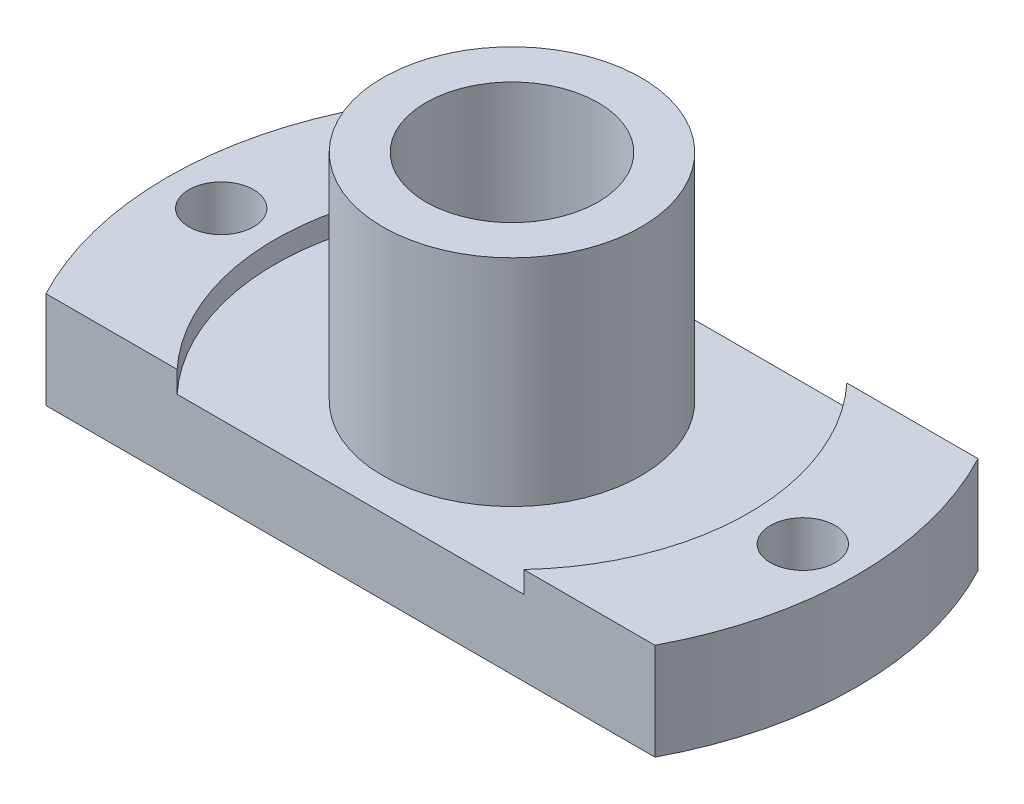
ISO-10303-21;
HEADER;
FILE_DESCRIPTION(('STEP AP214'),'2;1');
FILE_NAME('part.step','',(''),(''),'','','');
FILE_SCHEMA(('AUTOMOTIVE_DESIGN { 1 0 10303 214 1 1 1 1 }'));
ENDSEC;
DATA;
#1=APPLICATION_CONTEXT('core data for automotive mechanical design processes');
#2=APPLICATION_PROTOCOL_DEFINITION('international standard','automotive_design',2000,#1);
#3=PRODUCT_CONTEXT('',#1,'mechanical');
#4=PRODUCT('Part','Part','',(#3));
#5=PRODUCT_RELATED_PRODUCT_CATEGORY('part','',(#4));
#6=PRODUCT_DEFINITION_FORMATION('','',#4);
#7=PRODUCT_DEFINITION_CONTEXT('part definition',#1,'design');
#8=PRODUCT_DEFINITION('design','',#6,#7);
#9=PRODUCT_DEFINITION_SHAPE('','',#8);
#10=(LENGTH_UNIT() NAMED_UNIT(*) SI_UNIT(.MILLI.,.METRE.));
#11=(NAMED_UNIT(*) PLANE_ANGLE_UNIT() SI_UNIT($,.RADIAN.));
#12=(NAMED_UNIT(*) SI_UNIT($,.STERADIAN.) SOLID_ANGLE_UNIT());
#13=UNCERTAINTY_MEASURE_WITH_UNIT(LENGTH_MEASURE(1.E-05),#10,'distance_accuracy_value','');
#14=(GEOMETRIC_REPRESENTATION_CONTEXT(3) GLOBAL_UNCERTAINTY_ASSIGNED_CONTEXT((#13)) GLOBAL_UNIT_ASSIGNED_CONTEXT((#10,
#11,#12)) REPRESENTATION_CONTEXT('',''));
#15=CARTESIAN_POINT('',(0.,0.,0.));
#16=DIRECTION('',(0.,0.,1.));
#17=DIRECTION('',(1.,0.,0.));
#18=AXIS2_PLACEMENT_3D('',#15,#16,#17);
#19=CARTESIAN_POINT('',(0.,7.,0.));
#20=DIRECTION('',(0.,1.,0.));
#21=DIRECTION('',(0.,0.,1.));
#22=AXIS2_PLACEMENT_3D('',#19,#20,#21);
#23=PLANE('',#22);
#24=CARTESIAN_POINT('',(0.,7.,0.));
#25=DIRECTION('',(0.,1.,0.));
#26=DIRECTION('',(0.,0.,1.));
#27=AXIS2_PLACEMENT_3D('',#24,#25,#26);
#28=CIRCLE('',#27,12.);
#29=CARTESIAN_POINT('',(0.,7.,12.));
#30=VERTEX_POINT('',#29);
#31=EDGE_CURVE('E169',#30,#30,#28,.T.);
#32=ORIENTED_EDGE('',*,*,#31,.F.);
#33=EDGE_LOOP('',(#32));
#34=FACE_BOUND('',#33,.T.);
#35=DIRECTION('',(-1.,0.,0.));
#36=VECTOR('',#35,1.);
#37=CARTESIAN_POINT('',(-28.2665880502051,7.,15.));
#38=LINE('',#37,#36);
#39=CARTESIAN_POINT('',(16.0934769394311,7.,15.));
#40=VERTEX_POINT('',#39);
#41=CARTESIAN_POINT('',(-16.0934769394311,7.,15.));
#42=VERTEX_POINT('',#41);
#43=EDGE_CURVE('E158',#40,#42,#38,.T.);
#44=ORIENTED_EDGE('',*,*,#43,.F.);
#45=CARTESIAN_POINT('',(0.,7.,0.));
#46=DIRECTION('',(0.,-1.,0.));
#47=DIRECTION('',(0.,0.,1.));
#48=AXIS2_PLACEMENT_3D('',#45,#46,#47);
#49=CIRCLE('',#48,22.);
#50=CARTESIAN_POINT('',(16.0934769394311,7.,-15.));
#51=VERTEX_POINT('',#50);
#52=EDGE_CURVE('E125',#51,#40,#49,.T.);
#53=ORIENTED_EDGE('',*,*,#52,.F.);
#54=DIRECTION('',(1.,0.,0.));
#55=VECTOR('',#54,1.);
#56=CARTESIAN_POINT('',(-28.2665880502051,7.,-15.));
#57=LINE('',#56,#55);
#58=CARTESIAN_POINT('',(-16.0934769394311,7.,-15.));
#59=VERTEX_POINT('',#58);
#60=EDGE_CURVE('E156',#59,#51,#57,.T.);
#61=ORIENTED_EDGE('',*,*,#60,.F.);
#62=CARTESIAN_POINT('',(0.,7.,0.));
#63=DIRECTION('',(0.,-1.,0.));
#64=DIRECTION('',(0.,0.,-1.));
#65=AXIS2_PLACEMENT_3D('',#62,#63,#64);
#66=CIRCLE('',#65,22.);
#67=EDGE_CURVE('E46',#42,#59,#66,.T.);
#68=ORIENTED_EDGE('',*,*,#67,.F.);
#69=EDGE_LOOP('',(#44,#53,#61,#68));
#70=FACE_BOUND('',#69,.T.);
#71=ADVANCED_FACE('F31',(#34,#70),#23,.T.);
#72=CARTESIAN_POINT('',(0.,27.,0.));
#73=DIRECTION('',(0.,1.,0.));
#74=DIRECTION('',(0.,0.,1.));
#75=AXIS2_PLACEMENT_3D('',#72,#73,#74);
#76=PLANE('',#75);
#77=CARTESIAN_POINT('',(0.,27.,0.));
#78=DIRECTION('',(0.,1.,0.));
#79=DIRECTION('',(0.,0.,1.));
#80=AXIS2_PLACEMENT_3D('',#77,#78,#79);
#81=CIRCLE('',#80,12.);
#82=CARTESIAN_POINT('',(0.,27.,12.));
#83=VERTEX_POINT('',#82);
#84=EDGE_CURVE('E11',#83,#83,#81,.T.);
#85=ORIENTED_EDGE('',*,*,#84,.T.);
#86=EDGE_LOOP('',(#85));
#87=FACE_BOUND('',#86,.T.);
#88=CARTESIAN_POINT('',(0.,27.,0.));
#89=DIRECTION('',(0.,1.,0.));
#90=DIRECTION('',(0.,0.,1.));
#91=AXIS2_PLACEMENT_3D('',#88,#89,#90);
#92=CIRCLE('',#91,8.);
#93=CARTESIAN_POINT('',(0.,27.,8.));
#94=VERTEX_POINT('',#93);
#95=EDGE_CURVE('E39',#94,#94,#92,.T.);
#96=ORIENTED_EDGE('',*,*,#95,.F.);
#97=EDGE_LOOP('',(#96));
#98=FACE_BOUND('',#97,.T.);
#99=ADVANCED_FACE('F197',(#87,#98),#76,.T.);
#100=CARTESIAN_POINT('',(0.,0.,0.));
#101=DIRECTION('',(0.,1.,0.));
#102=DIRECTION('',(0.,0.,1.));
#103=AXIS2_PLACEMENT_3D('',#100,#101,#102);
#104=PLANE('',#103);
#105=CARTESIAN_POINT('',(-27.,0.,0.));
#106=DIRECTION('',(0.,1.,0.));
#107=DIRECTION('',(0.,0.,-1.));
#108=AXIS2_PLACEMENT_3D('',#105,#106,#107);
#109=CIRCLE('',#108,3.);
#110=CARTESIAN_POINT('',(-27.,0.,-3.));
#111=VERTEX_POINT('',#110);
#112=EDGE_CURVE('E247',#111,#111,#109,.T.);
#113=ORIENTED_EDGE('',*,*,#112,.T.);
#114=EDGE_LOOP('',(#113));
#115=FACE_BOUND('',#114,.T.);
#116=CARTESIAN_POINT('',(27.,0.,0.));
#117=DIRECTION('',(0.,1.,0.));
#118=DIRECTION('',(0.,0.,1.));
#119=AXIS2_PLACEMENT_3D('',#116,#117,#118);
#120=CIRCLE('',#119,3.);
#121=CARTESIAN_POINT('',(27.,0.,3.));
#122=VERTEX_POINT('',#121);
#123=EDGE_CURVE('E127',#122,#122,#120,.T.);
#124=ORIENTED_EDGE('',*,*,#123,.T.);
#125=EDGE_LOOP('',(#124));
#126=FACE_BOUND('',#125,.T.);
#127=CARTESIAN_POINT('',(0.,0.,0.));
#128=DIRECTION('',(0.,1.,0.));
#129=DIRECTION('',(0.,0.,1.));
#130=AXIS2_PLACEMENT_3D('',#127,#128,#129);
#131=CIRCLE('',#130,8.);
#132=CARTESIAN_POINT('',(0.,0.,8.));
#133=VERTEX_POINT('',#132);
#134=EDGE_CURVE('E174',#133,#133,#131,.T.);
#135=ORIENTED_EDGE('',*,*,#134,.T.);
#136=EDGE_LOOP('',(#135));
#137=FACE_BOUND('',#136,.T.);
#138=CARTESIAN_POINT('',(0.,0.,0.));
#139=DIRECTION('',(0.,-1.,0.));
#140=DIRECTION('',(0.,0.,1.));
#141=AXIS2_PLACEMENT_3D('',#138,#139,#140);
#142=CIRCLE('',#141,32.);
#143=CARTESIAN_POINT('',(-28.2665880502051,0.,15.));
#144=VERTEX_POINT('',#143);
#145=CARTESIAN_POINT('',(-28.2665880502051,0.,-15.));
#146=VERTEX_POINT('',#145);
#147=EDGE_CURVE('E155',#144,#146,#142,.T.);
#148=ORIENTED_EDGE('',*,*,#147,.T.);
#149=DIRECTION('',(1.,0.,0.));
#150=VECTOR('',#149,1.);
#151=CARTESIAN_POINT('',(-28.2665880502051,0.,-15.));
#152=LINE('',#151,#150);
#153=CARTESIAN_POINT('',(28.2665880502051,0.,-15.));
#154=VERTEX_POINT('',#153);
#155=EDGE_CURVE('E163',#146,#154,#152,.T.);
#156=ORIENTED_EDGE('',*,*,#155,.T.);
#157=CARTESIAN_POINT('',(0.,0.,0.));
#158=DIRECTION('',(0.,-1.,0.));
#159=DIRECTION('',(0.,0.,-1.));
#160=AXIS2_PLACEMENT_3D('',#157,#158,#159);
#161=CIRCLE('',#160,32.);
#162=CARTESIAN_POINT('',(28.2665880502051,0.,15.));
#163=VERTEX_POINT('',#162);
#164=EDGE_CURVE('E105',#154,#163,#161,.T.);
#165=ORIENTED_EDGE('',*,*,#164,.T.);
#166=DIRECTION('',(-1.,0.,0.));
#167=VECTOR('',#166,1.);
#168=CARTESIAN_POINT('',(-28.2665880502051,0.,15.));
#169=LINE('',#168,#167);
#170=EDGE_CURVE('E159',#163,#144,#169,.T.);
#171=ORIENTED_EDGE('',*,*,#170,.T.);
#172=EDGE_LOOP('',(#148,#156,#165,#171));
#173=FACE_BOUND('',#172,.T.);
#174=ADVANCED_FACE('F179',(#115,#126,#137,#173),#104,.F.);
#175=CARTESIAN_POINT('',(0.,27.,0.));
#176=DIRECTION('',(0.,-1.,0.));
#177=DIRECTION('',(0.,0.,-1.));
#178=AXIS2_PLACEMENT_3D('',#175,#176,#177);
#179=CYLINDRICAL_SURFACE('',#178,12.);
#180=ORIENTED_EDGE('',*,*,#31,.T.);
#181=EDGE_LOOP('',(#180));
#182=FACE_BOUND('',#181,.T.);
#183=ORIENTED_EDGE('',*,*,#84,.F.);
#184=EDGE_LOOP('',(#183));
#185=FACE_BOUND('',#184,.T.);
#186=ADVANCED_FACE('F33',(#182,#185),#179,.T.);
#187=CARTESIAN_POINT('',(0.,27.,0.));
#188=DIRECTION('',(0.,-1.,0.));
#189=DIRECTION('',(0.,0.,-1.));
#190=AXIS2_PLACEMENT_3D('',#187,#188,#189);
#191=CYLINDRICAL_SURFACE('',#190,8.);
#192=ORIENTED_EDGE('',*,*,#95,.T.);
#193=EDGE_LOOP('',(#192));
#194=FACE_BOUND('',#193,.T.);
#195=ORIENTED_EDGE('',*,*,#134,.F.);
#196=EDGE_LOOP('',(#195));
#197=FACE_BOUND('',#196,.T.);
#198=ADVANCED_FACE('F182',(#194,#197),#191,.F.);
#199=CARTESIAN_POINT('',(0.,7.,0.));
#200=DIRECTION('',(0.,-1.,0.));
#201=DIRECTION('',(0.,0.,-1.));
#202=AXIS2_PLACEMENT_3D('',#199,#200,#201);
#203=CYLINDRICAL_SURFACE('',#202,32.);
#204=ORIENTED_EDGE('',*,*,#147,.F.);
#205=DIRECTION('',(0.,-1.,0.));
#206=VECTOR('',#205,1.);
#207=CARTESIAN_POINT('',(-28.2665880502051,7.,15.));
#208=LINE('',#207,#206);
#209=CARTESIAN_POINT('',(-28.2665880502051,9.,15.));
#210=VERTEX_POINT('',#209);
#211=EDGE_CURVE('E54',#210,#144,#208,.T.);
#212=ORIENTED_EDGE('',*,*,#211,.F.);
#213=CARTESIAN_POINT('',(0.,9.,0.));
#214=DIRECTION('',(0.,1.,0.));
#215=DIRECTION('',(0.,0.,-1.));
#216=AXIS2_PLACEMENT_3D('',#213,#214,#215);
#217=CIRCLE('',#216,32.);
#218=CARTESIAN_POINT('',(-28.2665880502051,9.,-15.));
#219=VERTEX_POINT('',#218);
#220=EDGE_CURVE('E145',#219,#210,#217,.T.);
#221=ORIENTED_EDGE('',*,*,#220,.F.);
#222=DIRECTION('',(0.,-1.,0.));
#223=VECTOR('',#222,1.);
#224=CARTESIAN_POINT('',(-28.2665880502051,7.,-15.));
#225=LINE('',#224,#223);
#226=EDGE_CURVE('E110',#219,#146,#225,.T.);
#227=ORIENTED_EDGE('',*,*,#226,.T.);
#228=EDGE_LOOP('',(#204,#212,#221,#227));
#229=FACE_BOUND('',#228,.T.);
#230=ADVANCED_FACE('F184',(#229),#203,.T.);
#231=CARTESIAN_POINT('',(-28.2665880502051,7.,15.));
#232=DIRECTION('',(0.,0.,1.));
#233=DIRECTION('',(1.,0.,0.));
#234=AXIS2_PLACEMENT_3D('',#231,#232,#233);
#235=PLANE('',#234);
#236=ORIENTED_EDGE('',*,*,#170,.F.);
#237=DIRECTION('',(0.,-1.,0.));
#238=VECTOR('',#237,1.);
#239=CARTESIAN_POINT('',(28.2665880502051,7.,15.));
#240=LINE('',#239,#238);
#241=CARTESIAN_POINT('',(28.2665880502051,9.,15.));
#242=VERTEX_POINT('',#241);
#243=EDGE_CURVE('E109',#242,#163,#240,.T.);
#244=ORIENTED_EDGE('',*,*,#243,.F.);
#245=DIRECTION('',(1.,0.,0.));
#246=VECTOR('',#245,1.);
#247=CARTESIAN_POINT('',(28.2665880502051,9.,15.));
#248=LINE('',#247,#246);
#249=CARTESIAN_POINT('',(16.0934769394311,9.,15.));
#250=VERTEX_POINT('',#249);
#251=EDGE_CURVE('E124',#250,#242,#248,.T.);
#252=ORIENTED_EDGE('',*,*,#251,.F.);
#253=DIRECTION('',(0.,-1.,0.));
#254=VECTOR('',#253,1.);
#255=CARTESIAN_POINT('',(16.0934769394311,9.,15.));
#256=LINE('',#255,#254);
#257=EDGE_CURVE('E134',#250,#40,#256,.T.);
#258=ORIENTED_EDGE('',*,*,#257,.T.);
#259=ORIENTED_EDGE('',*,*,#43,.T.);
#260=DIRECTION('',(0.,-1.,0.));
#261=VECTOR('',#260,1.);
#262=CARTESIAN_POINT('',(-16.0934769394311,9.,15.));
#263=LINE('',#262,#261);
#264=CARTESIAN_POINT('',(-16.0934769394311,9.,15.));
#265=VERTEX_POINT('',#264);
#266=EDGE_CURVE('E150',#265,#42,#263,.T.);
#267=ORIENTED_EDGE('',*,*,#266,.F.);
#268=DIRECTION('',(1.,0.,0.));
#269=VECTOR('',#268,1.);
#270=CARTESIAN_POINT('',(-28.2665880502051,9.,15.));
#271=LINE('',#270,#269);
#272=EDGE_CURVE('E148',#210,#265,#271,.T.);
#273=ORIENTED_EDGE('',*,*,#272,.F.);
#274=ORIENTED_EDGE('',*,*,#211,.T.);
#275=EDGE_LOOP('',(#236,#244,#252,#258,#259,#267,#273,#274));
#276=FACE_BOUND('',#275,.T.);
#277=ADVANCED_FACE('F191',(#276),#235,.T.);
#278=CARTESIAN_POINT('',(0.,7.,0.));
#279=DIRECTION('',(0.,-1.,0.));
#280=DIRECTION('',(0.,0.,-1.));
#281=AXIS2_PLACEMENT_3D('',#278,#279,#280);
#282=CYLINDRICAL_SURFACE('',#281,32.);
#283=ORIENTED_EDGE('',*,*,#164,.F.);
#284=DIRECTION('',(0.,-1.,0.));
#285=VECTOR('',#284,1.);
#286=CARTESIAN_POINT('',(28.2665880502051,7.,-15.));
#287=LINE('',#286,#285);
#288=CARTESIAN_POINT('',(28.2665880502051,9.,-15.));
#289=VERTEX_POINT('',#288);
#290=EDGE_CURVE('E99',#289,#154,#287,.T.);
#291=ORIENTED_EDGE('',*,*,#290,.F.);
#292=CARTESIAN_POINT('',(0.,9.,0.));
#293=DIRECTION('',(0.,1.,0.));
#294=DIRECTION('',(0.,0.,1.));
#295=AXIS2_PLACEMENT_3D('',#292,#293,#294);
#296=CIRCLE('',#295,32.);
#297=EDGE_CURVE('E103',#242,#289,#296,.T.);
#298=ORIENTED_EDGE('',*,*,#297,.F.);
#299=ORIENTED_EDGE('',*,*,#243,.T.);
#300=EDGE_LOOP('',(#283,#291,#298,#299));
#301=FACE_BOUND('',#300,.T.);
#302=ADVANCED_FACE('F101',(#301),#282,.T.);
#303=CARTESIAN_POINT('',(-28.2665880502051,7.,-15.));
#304=DIRECTION('',(0.,0.,-1.));
#305=DIRECTION('',(-1.,0.,0.));
#306=AXIS2_PLACEMENT_3D('',#303,#304,#305);
#307=PLANE('',#306);
#308=ORIENTED_EDGE('',*,*,#155,.F.);
#309=ORIENTED_EDGE('',*,*,#226,.F.);
#310=DIRECTION('',(-1.,0.,0.));
#311=VECTOR('',#310,1.);
#312=CARTESIAN_POINT('',(-28.2665880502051,9.,-15.));
#313=LINE('',#312,#311);
#314=CARTESIAN_POINT('',(-16.0934769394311,9.,-15.));
#315=VERTEX_POINT('',#314);
#316=EDGE_CURVE('E142',#315,#219,#313,.T.);
#317=ORIENTED_EDGE('',*,*,#316,.F.);
#318=DIRECTION('',(0.,-1.,0.));
#319=VECTOR('',#318,1.);
#320=CARTESIAN_POINT('',(-16.0934769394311,9.,-15.));
#321=LINE('',#320,#319);
#322=EDGE_CURVE('E153',#315,#59,#321,.T.);
#323=ORIENTED_EDGE('',*,*,#322,.T.);
#324=ORIENTED_EDGE('',*,*,#60,.T.);
#325=DIRECTION('',(0.,-1.,0.));
#326=VECTOR('',#325,1.);
#327=CARTESIAN_POINT('',(16.0934769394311,9.,-15.));
#328=LINE('',#327,#326);
#329=CARTESIAN_POINT('',(16.0934769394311,9.,-15.));
#330=VERTEX_POINT('',#329);
#331=EDGE_CURVE('E116',#330,#51,#328,.T.);
#332=ORIENTED_EDGE('',*,*,#331,.F.);
#333=DIRECTION('',(-1.,0.,0.));
#334=VECTOR('',#333,1.);
#335=CARTESIAN_POINT('',(28.2665880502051,9.,-15.));
#336=LINE('',#335,#334);
#337=EDGE_CURVE('E113',#289,#330,#336,.T.);
#338=ORIENTED_EDGE('',*,*,#337,.F.);
#339=ORIENTED_EDGE('',*,*,#290,.T.);
#340=EDGE_LOOP('',(#308,#309,#317,#323,#324,#332,#338,#339));
#341=FACE_BOUND('',#340,.T.);
#342=ADVANCED_FACE('F114',(#341),#307,.T.);
#343=CARTESIAN_POINT('',(0.,9.,0.));
#344=DIRECTION('',(0.,-1.,0.));
#345=DIRECTION('',(0.,0.,-1.));
#346=AXIS2_PLACEMENT_3D('',#343,#344,#345);
#347=CYLINDRICAL_SURFACE('',#346,22.);
#348=ORIENTED_EDGE('',*,*,#67,.T.);
#349=ORIENTED_EDGE('',*,*,#322,.F.);
#350=CARTESIAN_POINT('',(0.,9.,0.));
#351=DIRECTION('',(0.,-1.,0.));
#352=DIRECTION('',(0.,0.,-1.));
#353=AXIS2_PLACEMENT_3D('',#350,#351,#352);
#354=CIRCLE('',#353,22.);
#355=EDGE_CURVE('E139',#265,#315,#354,.T.);
#356=ORIENTED_EDGE('',*,*,#355,.F.);
#357=ORIENTED_EDGE('',*,*,#266,.T.);
#358=EDGE_LOOP('',(#348,#349,#356,#357));
#359=FACE_BOUND('',#358,.T.);
#360=ADVANCED_FACE('F208',(#359),#347,.F.);
#361=CARTESIAN_POINT('',(0.,9.,0.));
#362=DIRECTION('',(0.,-1.,0.));
#363=DIRECTION('',(0.,0.,-1.));
#364=AXIS2_PLACEMENT_3D('',#361,#362,#363);
#365=PLANE('',#364);
#366=CARTESIAN_POINT('',(-27.,9.,0.));
#367=DIRECTION('',(0.,1.,0.));
#368=DIRECTION('',(0.,0.,-1.));
#369=AXIS2_PLACEMENT_3D('',#366,#367,#368);
#370=CIRCLE('',#369,3.);
#371=CARTESIAN_POINT('',(-27.,9.,-3.));
#372=VERTEX_POINT('',#371);
#373=EDGE_CURVE('E249',#372,#372,#370,.T.);
#374=ORIENTED_EDGE('',*,*,#373,.F.);
#375=EDGE_LOOP('',(#374));
#376=FACE_BOUND('',#375,.T.);
#377=ORIENTED_EDGE('',*,*,#355,.T.);
#378=ORIENTED_EDGE('',*,*,#316,.T.);
#379=ORIENTED_EDGE('',*,*,#220,.T.);
#380=ORIENTED_EDGE('',*,*,#272,.T.);
#381=EDGE_LOOP('',(#377,#378,#379,#380));
#382=FACE_BOUND('',#381,.T.);
#383=ADVANCED_FACE('F218',(#376,#382),#365,.F.);
#384=CARTESIAN_POINT('',(0.,9.,0.));
#385=DIRECTION('',(0.,-1.,0.));
#386=DIRECTION('',(0.,0.,-1.));
#387=AXIS2_PLACEMENT_3D('',#384,#385,#386);
#388=CYLINDRICAL_SURFACE('',#387,22.);
#389=ORIENTED_EDGE('',*,*,#52,.T.);
#390=ORIENTED_EDGE('',*,*,#257,.F.);
#391=CARTESIAN_POINT('',(0.,9.,0.));
#392=DIRECTION('',(0.,-1.,0.));
#393=DIRECTION('',(0.,0.,1.));
#394=AXIS2_PLACEMENT_3D('',#391,#392,#393);
#395=CIRCLE('',#394,22.);
#396=EDGE_CURVE('E119',#330,#250,#395,.T.);
#397=ORIENTED_EDGE('',*,*,#396,.F.);
#398=ORIENTED_EDGE('',*,*,#331,.T.);
#399=EDGE_LOOP('',(#389,#390,#397,#398));
#400=FACE_BOUND('',#399,.T.);
#401=ADVANCED_FACE('F222',(#400),#388,.F.);
#402=CARTESIAN_POINT('',(0.,9.,0.));
#403=DIRECTION('',(0.,1.,0.));
#404=DIRECTION('',(0.,0.,1.));
#405=AXIS2_PLACEMENT_3D('',#402,#403,#404);
#406=PLANE('',#405);
#407=CARTESIAN_POINT('',(27.,9.,0.));
#408=DIRECTION('',(0.,1.,0.));
#409=DIRECTION('',(0.,0.,1.));
#410=AXIS2_PLACEMENT_3D('',#407,#408,#409);
#411=CIRCLE('',#410,3.);
#412=CARTESIAN_POINT('',(27.,9.,3.));
#413=VERTEX_POINT('',#412);
#414=EDGE_CURVE('E130',#413,#413,#411,.T.);
#415=ORIENTED_EDGE('',*,*,#414,.F.);
#416=EDGE_LOOP('',(#415));
#417=FACE_BOUND('',#416,.T.);
#418=ORIENTED_EDGE('',*,*,#297,.T.);
#419=ORIENTED_EDGE('',*,*,#337,.T.);
#420=ORIENTED_EDGE('',*,*,#396,.T.);
#421=ORIENTED_EDGE('',*,*,#251,.T.);
#422=EDGE_LOOP('',(#418,#419,#420,#421));
#423=FACE_BOUND('',#422,.T.);
#424=ADVANCED_FACE('F122',(#417,#423),#406,.T.);
#425=CARTESIAN_POINT('',(27.,0.,0.));
#426=DIRECTION('',(0.,1.,0.));
#427=DIRECTION('',(0.,0.,1.));
#428=AXIS2_PLACEMENT_3D('',#425,#426,#427);
#429=CYLINDRICAL_SURFACE('',#428,3.);
#430=ORIENTED_EDGE('',*,*,#123,.F.);
#431=EDGE_LOOP('',(#430));
#432=FACE_BOUND('',#431,.T.);
#433=ORIENTED_EDGE('',*,*,#414,.T.);
#434=EDGE_LOOP('',(#433));
#435=FACE_BOUND('',#434,.T.);
#436=ADVANCED_FACE('F234',(#432,#435),#429,.F.);
#437=CARTESIAN_POINT('',(-27.,0.,0.));
#438=DIRECTION('',(0.,1.,0.));
#439=DIRECTION('',(0.,0.,1.));
#440=AXIS2_PLACEMENT_3D('',#437,#438,#439);
#441=CYLINDRICAL_SURFACE('',#440,3.);
#442=ORIENTED_EDGE('',*,*,#112,.F.);
#443=EDGE_LOOP('',(#442));
#444=FACE_BOUND('',#443,.T.);
#445=ORIENTED_EDGE('',*,*,#373,.T.);
#446=EDGE_LOOP('',(#445));
#447=FACE_BOUND('',#446,.T.);
#448=ADVANCED_FACE('F238',(#444,#447),#441,.F.);
#449=CLOSED_SHELL('',(#71,#99,#174,#186,#198,#230,#277,#302,#342,#360,#383,#401,#424,#436,#448));
#450=MANIFOLD_SOLID_BREP('B2',#449);
#451=ADVANCED_BREP_SHAPE_REPRESENTATION('',(#18,#450),#14);
#452=SHAPE_DEFINITION_REPRESENTATION(#9,#451);
ENDSEC;
END-ISO-10303-21;
